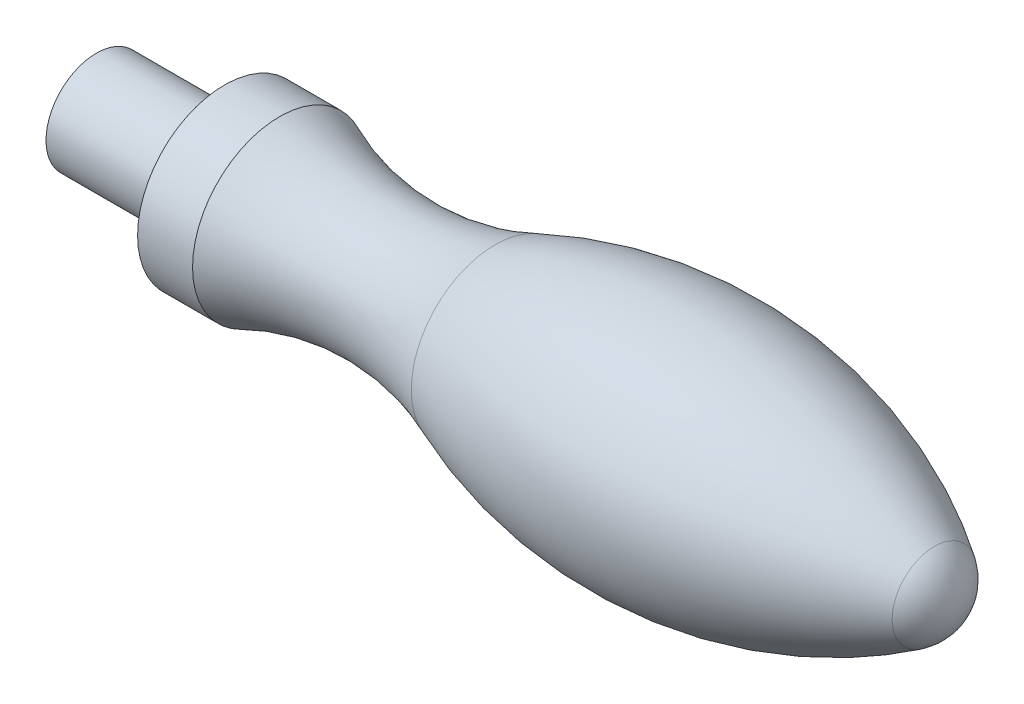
from build123d import *


with BuildPart() as part:
    # Sketch 1 → Revolve 1 (revolve)
    with BuildSketch(Plane.XY, mode=Mode.PRIVATE) as revolve_1_sk:
        with BuildLine():
            Line((-76.588275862, 0), (-76.588275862, 5.5))
            Line((-76.588275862, 5.5), (-62.588275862, 5.5))
            Line((-62.588275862, 5.5), (-62.588275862, 9.5))
            Line((-62.588275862, 9.5), (-56.588275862, 9.5))
            ThreePointArc((-56.588275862, 9.5), (-44.864437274, 6.91937033), (-33.067449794, 9.141785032))
            ThreePointArc((-33.067449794, 9.141785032), (-8.524007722, 12.769831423), (14.906907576, 4.612903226))
            ThreePointArc((14.906907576, 4.612903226), (16.745124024, 2.624546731), (17.411724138, 0))
            Line((17.411724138, 0), (-76.588275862, 0))
        make_face()
    revolve(revolve_1_sk.sketch.rotate(Axis((-76.588275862, 0, 0), (1, 0, 0)), 90), axis=Axis((-76.588275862, 0, 0), (1, 0, 0)))


solid = part.part
